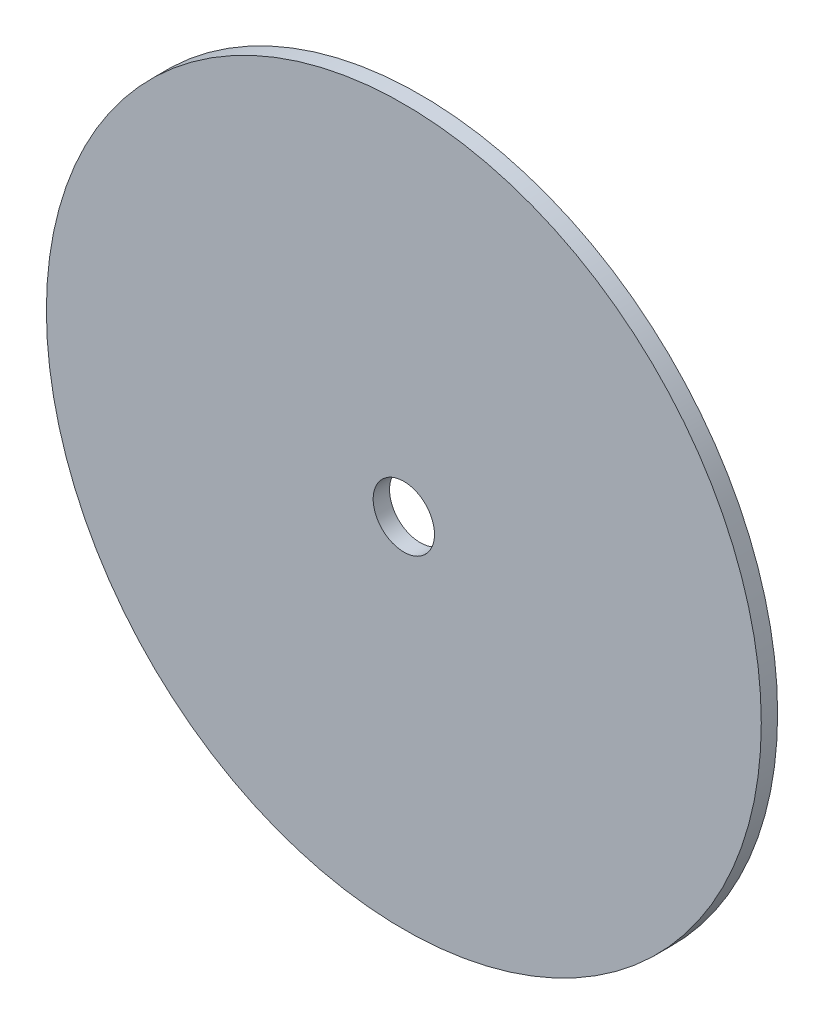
from build123d import *

# Parameters (mm, degrees)
CROQUIS1_R              = 175
CROQUIS1_R_2            = 15
SALIENTE_EXTRUIR1_DEPTH = 8


with BuildPart() as part:
    # Croquis1 → Saliente-Extruir1 (new body)
    with BuildSketch(Plane.XY):
        Circle(CROQUIS1_R)
        Circle(CROQUIS1_R_2, mode=Mode.SUBTRACT)
    extrude(amount=SALIENTE_EXTRUIR1_DEPTH)


solid = part.part
